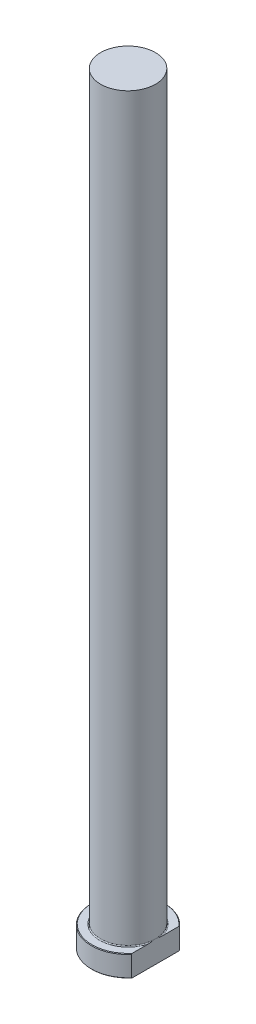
from build123d import *
from build123d.topology import SkipClean

# Parameters (mm, degrees)
CHAMFER1_SIZE = 0.2
FILLET1_R     = 0.3
KEY_DEPTH     = 251.575337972


with BuildPart() as part:
    # Sketch1 → Revolve1 (revolve)
    with BuildSketch(Plane.XY, mode=Mode.PRIVATE) as revolve1_sk:
        Polygon((0, 0), (-12, 0), (-12, 7), (-9, 7), (-9, 250), (0, 250), align=None)
    revolve(revolve1_sk.sketch.rotate(Axis((0, 259.958771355, 0), (0, -1, 0)), 270), axis=Axis((0, 259.958771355, 0), (0, -1, 0)))

    # Chamfer1
    chamfer1_edges = [part.edges().sort_by_distance(p)[0] for p in [
        (0, 7, -12),
        (0, 0, -12),
    ]]
    chamfer(chamfer1_edges, length=CHAMFER1_SIZE)

    # Fillet1
    fillet1_edges = [part.edges().sort_by_distance(p)[0] for p in [
        (0, 7, -9),
    ]]
    fillet(fillet1_edges, radius=FILLET1_R)

    # Sketch2 → KEY (cut, through all)
    with SkipClean():  # the faces are left unmerged after this step: merging them gives an invalid solid
        with BuildSketch(Plane(origin=(0, 0, 0), x_dir=(1, 0, 0), z_dir=(0, 1, 0))):
            with BuildLine():
                Line((9, 7.937253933), (9, -7.937253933))
                ThreePointArc((9, -7.937253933), (12, 0), (9, 7.937253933))
            make_face()
        extrude(amount=KEY_DEPTH, mode=Mode.SUBTRACT)


solid = part.part
